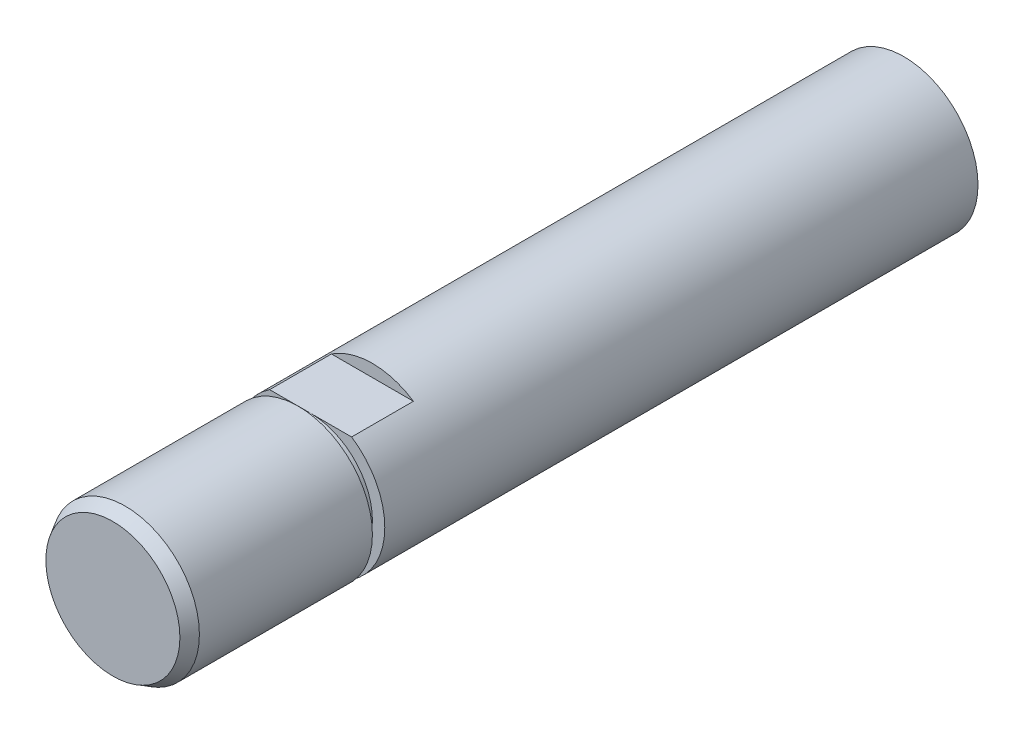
ISO-10303-21;
HEADER;
FILE_DESCRIPTION(('STEP AP214'),'2;1');
FILE_NAME('part.step','',(''),(''),'','','');
FILE_SCHEMA(('AUTOMOTIVE_DESIGN { 1 0 10303 214 1 1 1 1 }'));
ENDSEC;
DATA;
#1=APPLICATION_CONTEXT('core data for automotive mechanical design processes');
#2=APPLICATION_PROTOCOL_DEFINITION('international standard','automotive_design',2000,#1);
#3=PRODUCT_CONTEXT('',#1,'mechanical');
#4=PRODUCT('Part','Part','',(#3));
#5=PRODUCT_RELATED_PRODUCT_CATEGORY('part','',(#4));
#6=PRODUCT_DEFINITION_FORMATION('','',#4);
#7=PRODUCT_DEFINITION_CONTEXT('part definition',#1,'design');
#8=PRODUCT_DEFINITION('design','',#6,#7);
#9=PRODUCT_DEFINITION_SHAPE('','',#8);
#10=(LENGTH_UNIT() NAMED_UNIT(*) SI_UNIT(.MILLI.,.METRE.));
#11=(NAMED_UNIT(*) PLANE_ANGLE_UNIT() SI_UNIT($,.RADIAN.));
#12=(NAMED_UNIT(*) SI_UNIT($,.STERADIAN.) SOLID_ANGLE_UNIT());
#13=UNCERTAINTY_MEASURE_WITH_UNIT(LENGTH_MEASURE(1.E-05),#10,'distance_accuracy_value','');
#14=(GEOMETRIC_REPRESENTATION_CONTEXT(3) GLOBAL_UNCERTAINTY_ASSIGNED_CONTEXT((#13)) GLOBAL_UNIT_ASSIGNED_CONTEXT((#10,
#11,#12)) REPRESENTATION_CONTEXT('',''));
#15=CARTESIAN_POINT('',(0.,0.,0.));
#16=DIRECTION('',(0.,0.,1.));
#17=DIRECTION('',(1.,0.,0.));
#18=AXIS2_PLACEMENT_3D('',#15,#16,#17);
#19=CARTESIAN_POINT('',(0.,0.,8.));
#20=DIRECTION('',(0.,0.,1.));
#21=DIRECTION('',(1.,0.,0.));
#22=AXIS2_PLACEMENT_3D('',#19,#20,#21);
#23=PLANE('',#22);
#24=DIRECTION('',(1.,0.,0.));
#25=VECTOR('',#24,1.);
#26=CARTESIAN_POINT('',(-10.5,-5.,8.));
#27=LINE('',#26,#25);
#28=CARTESIAN_POINT('',(0.,-5.,8.));
#29=VERTEX_POINT('',#28);
#30=CARTESIAN_POINT('',(3.3166247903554,-5.,8.));
#31=VERTEX_POINT('',#30);
#32=EDGE_CURVE('E90',#29,#31,#27,.T.);
#33=ORIENTED_EDGE('',*,*,#32,.T.);
#34=CARTESIAN_POINT('',(0.,0.,8.));
#35=DIRECTION('',(0.,0.,1.));
#36=DIRECTION('',(1.,0.,0.));
#37=AXIS2_PLACEMENT_3D('',#34,#35,#36);
#38=CIRCLE('',#37,6.);
#39=CARTESIAN_POINT('',(3.3166247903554,5.,8.));
#40=VERTEX_POINT('',#39);
#41=EDGE_CURVE('E97',#40,#31,#38,.F.);
#42=ORIENTED_EDGE('',*,*,#41,.F.);
#43=DIRECTION('',(1.,0.,0.));
#44=VECTOR('',#43,1.);
#45=CARTESIAN_POINT('',(-10.5,5.,8.));
#46=LINE('',#45,#44);
#47=CARTESIAN_POINT('',(0.,5.,8.));
#48=VERTEX_POINT('',#47);
#49=EDGE_CURVE('E125',#48,#40,#46,.T.);
#50=ORIENTED_EDGE('',*,*,#49,.F.);
#51=CARTESIAN_POINT('',(0.,0.,8.));
#52=DIRECTION('',(0.,0.,1.));
#53=DIRECTION('',(1.,0.,0.));
#54=AXIS2_PLACEMENT_3D('',#51,#52,#53);
#55=CIRCLE('',#54,5.);
#56=EDGE_CURVE('E122',#29,#48,#55,.T.);
#57=ORIENTED_EDGE('',*,*,#56,.F.);
#58=EDGE_LOOP('',(#33,#42,#50,#57));
#59=FACE_BOUND('',#58,.T.);
#60=ADVANCED_FACE('F35',(#59),#23,.T.);
#61=CARTESIAN_POINT('',(0.,0.,-40.));
#62=DIRECTION('',(0.,0.,1.));
#63=DIRECTION('',(1.,0.,0.));
#64=AXIS2_PLACEMENT_3D('',#61,#62,#63);
#65=CYLINDRICAL_SURFACE('',#64,6.);
#66=CARTESIAN_POINT('',(0.,0.,9.));
#67=DIRECTION('',(0.,0.,1.));
#68=DIRECTION('',(1.,0.,0.));
#69=AXIS2_PLACEMENT_3D('',#66,#67,#68);
#70=CIRCLE('',#69,6.);
#71=CARTESIAN_POINT('',(6.,0.,9.));
#72=VERTEX_POINT('',#71);
#73=EDGE_CURVE('E105',#72,#72,#70,.F.);
#74=ORIENTED_EDGE('',*,*,#73,.F.);
#75=EDGE_LOOP('',(#74));
#76=FACE_BOUND('',#75,.T.);
#77=CARTESIAN_POINT('',(0.,0.,23.));
#78=DIRECTION('',(0.,0.,1.));
#79=DIRECTION('',(1.,0.,0.));
#80=AXIS2_PLACEMENT_3D('',#77,#78,#79);
#81=CIRCLE('',#80,6.);
#82=CARTESIAN_POINT('',(6.,0.,23.));
#83=VERTEX_POINT('',#82);
#84=EDGE_CURVE('E104',#83,#83,#81,.F.);
#85=ORIENTED_EDGE('',*,*,#84,.T.);
#86=EDGE_LOOP('',(#85));
#87=FACE_BOUND('',#86,.T.);
#88=ADVANCED_FACE('F158',(#76,#87),#65,.T.);
#89=CARTESIAN_POINT('',(0.,0.,24.));
#90=DIRECTION('',(0.,0.,1.));
#91=DIRECTION('',(1.,0.,0.));
#92=AXIS2_PLACEMENT_3D('',#89,#90,#91);
#93=PLANE('',#92);
#94=CARTESIAN_POINT('',(0.,0.,24.));
#95=DIRECTION('',(0.,0.,1.));
#96=DIRECTION('',(1.,0.,0.));
#97=AXIS2_PLACEMENT_3D('',#94,#95,#96);
#98=CIRCLE('',#97,5.42264973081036);
#99=CARTESIAN_POINT('',(5.42264973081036,0.,24.));
#100=VERTEX_POINT('',#99);
#101=EDGE_CURVE('E113',#100,#100,#98,.T.);
#102=ORIENTED_EDGE('',*,*,#101,.T.);
#103=EDGE_LOOP('',(#102));
#104=FACE_BOUND('',#103,.T.);
#105=ADVANCED_FACE('F162',(#104),#93,.T.);
#106=CARTESIAN_POINT('',(0.,0.,24.));
#107=DIRECTION('',(0.,0.,-1.));
#108=DIRECTION('',(-1.,0.,0.));
#109=AXIS2_PLACEMENT_3D('',#106,#107,#108);
#110=CONICAL_SURFACE('',#109,5.42264973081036,0.523598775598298);
#111=ORIENTED_EDGE('',*,*,#84,.F.);
#112=EDGE_LOOP('',(#111));
#113=FACE_BOUND('',#112,.T.);
#114=ORIENTED_EDGE('',*,*,#101,.F.);
#115=EDGE_LOOP('',(#114));
#116=FACE_BOUND('',#115,.T.);
#117=ADVANCED_FACE('F37',(#113,#116),#110,.T.);
#118=CARTESIAN_POINT('',(0.,0.,9.));
#119=DIRECTION('',(0.,0.,1.));
#120=DIRECTION('',(1.,0.,0.));
#121=AXIS2_PLACEMENT_3D('',#118,#119,#120);
#122=PLANE('',#121);
#123=ORIENTED_EDGE('',*,*,#73,.T.);
#124=EDGE_LOOP('',(#123));
#125=FACE_BOUND('',#124,.T.);
#126=CARTESIAN_POINT('',(0.,0.,9.));
#127=DIRECTION('',(0.,0.,1.));
#128=DIRECTION('',(1.,0.,0.));
#129=AXIS2_PLACEMENT_3D('',#126,#127,#128);
#130=CIRCLE('',#129,5.);
#131=CARTESIAN_POINT('',(5.,0.,9.));
#132=VERTEX_POINT('',#131);
#133=EDGE_CURVE('E121',#132,#132,#130,.T.);
#134=ORIENTED_EDGE('',*,*,#133,.T.);
#135=EDGE_LOOP('',(#134));
#136=FACE_BOUND('',#135,.T.);
#137=ADVANCED_FACE('F152',(#125,#136),#122,.F.);
#138=CARTESIAN_POINT('',(-3.3166247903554,-5.,8.));
#139=VERTEX_POINT('',#138);
#140=EDGE_CURVE('E128',#139,#29,#27,.T.);
#141=ORIENTED_EDGE('',*,*,#140,.T.);
#142=EDGE_CURVE('E118',#48,#29,#55,.T.);
#143=ORIENTED_EDGE('',*,*,#142,.F.);
#144=CARTESIAN_POINT('',(-3.3166247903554,5.,8.));
#145=VERTEX_POINT('',#144);
#146=EDGE_CURVE('E127',#145,#48,#46,.T.);
#147=ORIENTED_EDGE('',*,*,#146,.F.);
#148=EDGE_CURVE('E110',#139,#145,#38,.F.);
#149=ORIENTED_EDGE('',*,*,#148,.F.);
#150=EDGE_LOOP('',(#141,#143,#147,#149));
#151=FACE_BOUND('',#150,.T.);
#152=ADVANCED_FACE('F136',(#151),#23,.T.);
#153=CARTESIAN_POINT('',(0.,0.,9.));
#154=DIRECTION('',(0.,0.,-1.));
#155=DIRECTION('',(-1.,0.,0.));
#156=AXIS2_PLACEMENT_3D('',#153,#154,#155);
#157=CYLINDRICAL_SURFACE('',#156,5.);
#158=ORIENTED_EDGE('',*,*,#133,.F.);
#159=EDGE_LOOP('',(#158));
#160=FACE_BOUND('',#159,.T.);
#161=ORIENTED_EDGE('',*,*,#142,.T.);
#162=ORIENTED_EDGE('',*,*,#56,.T.);
#163=EDGE_LOOP('',(#161,#162));
#164=FACE_BOUND('',#163,.T.);
#165=ADVANCED_FACE('F141',(#160,#164),#157,.T.);
#166=CARTESIAN_POINT('',(0.,0.,-40.));
#167=DIRECTION('',(0.,0.,1.));
#168=DIRECTION('',(1.,0.,0.));
#169=AXIS2_PLACEMENT_3D('',#166,#167,#168);
#170=PLANE('',#169);
#171=CARTESIAN_POINT('',(0.,0.,-40.));
#172=DIRECTION('',(0.,0.,1.));
#173=DIRECTION('',(1.,0.,0.));
#174=AXIS2_PLACEMENT_3D('',#171,#172,#173);
#175=CIRCLE('',#174,6.);
#176=CARTESIAN_POINT('',(6.,0.,-40.));
#177=VERTEX_POINT('',#176);
#178=EDGE_CURVE('E108',#177,#177,#175,.T.);
#179=ORIENTED_EDGE('',*,*,#178,.F.);
#180=EDGE_LOOP('',(#179));
#181=FACE_BOUND('',#180,.T.);
#182=ADVANCED_FACE('F143',(#181),#170,.F.);
#183=DIRECTION('',(0.,0.,1.));
#184=VECTOR('',#183,1.);
#185=CARTESIAN_POINT('',(-3.3166247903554,-5.,-40.));
#186=LINE('',#185,#184);
#187=CARTESIAN_POINT('',(-3.3166247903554,-5.,2.99999999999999));
#188=VERTEX_POINT('',#187);
#189=EDGE_CURVE('E11',#139,#188,#186,.F.);
#190=ORIENTED_EDGE('',*,*,#189,.F.);
#191=ORIENTED_EDGE('',*,*,#148,.T.);
#192=DIRECTION('',(0.,0.,1.));
#193=VECTOR('',#192,1.);
#194=CARTESIAN_POINT('',(-3.3166247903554,5.,-40.));
#195=LINE('',#194,#193);
#196=CARTESIAN_POINT('',(-3.3166247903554,5.,3.));
#197=VERTEX_POINT('',#196);
#198=EDGE_CURVE('E102',#197,#145,#195,.T.);
#199=ORIENTED_EDGE('',*,*,#198,.F.);
#200=CARTESIAN_POINT('',(0.,0.,3.));
#201=DIRECTION('',(0.,0.,-1.));
#202=DIRECTION('',(0.,1.,0.));
#203=AXIS2_PLACEMENT_3D('',#200,#201,#202);
#204=CIRCLE('',#203,6.);
#205=CARTESIAN_POINT('',(3.3166247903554,5.,3.));
#206=VERTEX_POINT('',#205);
#207=EDGE_CURVE('E100',#206,#197,#204,.F.);
#208=ORIENTED_EDGE('',*,*,#207,.F.);
#209=DIRECTION('',(0.,0.,1.));
#210=VECTOR('',#209,1.);
#211=CARTESIAN_POINT('',(3.3166247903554,5.,-40.));
#212=LINE('',#211,#210);
#213=EDGE_CURVE('E85',#40,#206,#212,.F.);
#214=ORIENTED_EDGE('',*,*,#213,.F.);
#215=ORIENTED_EDGE('',*,*,#41,.T.);
#216=DIRECTION('',(0.,0.,1.));
#217=VECTOR('',#216,1.);
#218=CARTESIAN_POINT('',(3.3166247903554,-5.,-40.));
#219=LINE('',#218,#217);
#220=CARTESIAN_POINT('',(3.3166247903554,-5.,2.99999999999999));
#221=VERTEX_POINT('',#220);
#222=EDGE_CURVE('E43',#221,#31,#219,.T.);
#223=ORIENTED_EDGE('',*,*,#222,.F.);
#224=CARTESIAN_POINT('',(0.,0.,3.));
#225=DIRECTION('',(0.,0.,-1.));
#226=DIRECTION('',(0.,1.,0.));
#227=AXIS2_PLACEMENT_3D('',#224,#225,#226);
#228=CIRCLE('',#227,6.);
#229=EDGE_CURVE('E80',#188,#221,#228,.F.);
#230=ORIENTED_EDGE('',*,*,#229,.F.);
#231=EDGE_LOOP('',(#190,#191,#199,#208,#214,#215,#223,#230));
#232=FACE_BOUND('',#231,.T.);
#233=ORIENTED_EDGE('',*,*,#178,.T.);
#234=EDGE_LOOP('',(#233));
#235=FACE_BOUND('',#234,.T.);
#236=ADVANCED_FACE('F93',(#232,#235),#65,.T.);
#237=CARTESIAN_POINT('',(-10.5,10.381540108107,3.));
#238=DIRECTION('',(0.,0.,-1.));
#239=DIRECTION('',(0.,1.,0.));
#240=AXIS2_PLACEMENT_3D('',#237,#238,#239);
#241=PLANE('',#240);
#242=ORIENTED_EDGE('',*,*,#207,.T.);
#243=DIRECTION('',(1.,0.,0.));
#244=VECTOR('',#243,1.);
#245=CARTESIAN_POINT('',(-10.5,5.,3.));
#246=LINE('',#245,#244);
#247=EDGE_CURVE('E56',#197,#206,#246,.T.);
#248=ORIENTED_EDGE('',*,*,#247,.T.);
#249=EDGE_LOOP('',(#242,#248));
#250=FACE_BOUND('',#249,.T.);
#251=ADVANCED_FACE('F203',(#250),#241,.F.);
#252=CARTESIAN_POINT('',(-10.5,5.,8.));
#253=DIRECTION('',(0.,-1.,0.));
#254=DIRECTION('',(0.,0.,-1.));
#255=AXIS2_PLACEMENT_3D('',#252,#253,#254);
#256=PLANE('',#255);
#257=ORIENTED_EDGE('',*,*,#213,.T.);
#258=ORIENTED_EDGE('',*,*,#247,.F.);
#259=ORIENTED_EDGE('',*,*,#198,.T.);
#260=ORIENTED_EDGE('',*,*,#146,.T.);
#261=ORIENTED_EDGE('',*,*,#49,.T.);
#262=EDGE_LOOP('',(#257,#258,#259,#260,#261));
#263=FACE_BOUND('',#262,.T.);
#264=ADVANCED_FACE('F212',(#263),#256,.F.);
#265=CARTESIAN_POINT('',(-10.5,-5.,8.));
#266=DIRECTION('',(0.,1.,0.));
#267=DIRECTION('',(0.,0.,1.));
#268=AXIS2_PLACEMENT_3D('',#265,#266,#267);
#269=PLANE('',#268);
#270=ORIENTED_EDGE('',*,*,#189,.T.);
#271=DIRECTION('',(1.,0.,0.));
#272=VECTOR('',#271,1.);
#273=CARTESIAN_POINT('',(-10.5,-5.,3.));
#274=LINE('',#273,#272);
#275=EDGE_CURVE('E49',#188,#221,#274,.T.);
#276=ORIENTED_EDGE('',*,*,#275,.T.);
#277=ORIENTED_EDGE('',*,*,#222,.T.);
#278=ORIENTED_EDGE('',*,*,#32,.F.);
#279=ORIENTED_EDGE('',*,*,#140,.F.);
#280=EDGE_LOOP('',(#270,#276,#277,#278,#279));
#281=FACE_BOUND('',#280,.T.);
#282=ADVANCED_FACE('F88',(#281),#269,.F.);
#283=CARTESIAN_POINT('',(-10.5,-5.,3.));
#284=DIRECTION('',(0.,0.,-1.));
#285=DIRECTION('',(0.,1.,0.));
#286=AXIS2_PLACEMENT_3D('',#283,#284,#285);
#287=PLANE('',#286);
#288=ORIENTED_EDGE('',*,*,#229,.T.);
#289=ORIENTED_EDGE('',*,*,#275,.F.);
#290=EDGE_LOOP('',(#288,#289));
#291=FACE_BOUND('',#290,.T.);
#292=ADVANCED_FACE('F81',(#291),#287,.F.);
#293=CLOSED_SHELL('',(#60,#88,#105,#117,#137,#152,#165,#182,#236,#251,#264,#282,#292));
#294=MANIFOLD_SOLID_BREP('B2',#293);
#295=ADVANCED_BREP_SHAPE_REPRESENTATION('',(#18,#294),#14);
#296=SHAPE_DEFINITION_REPRESENTATION(#9,#295);
ENDSEC;
END-ISO-10303-21;
